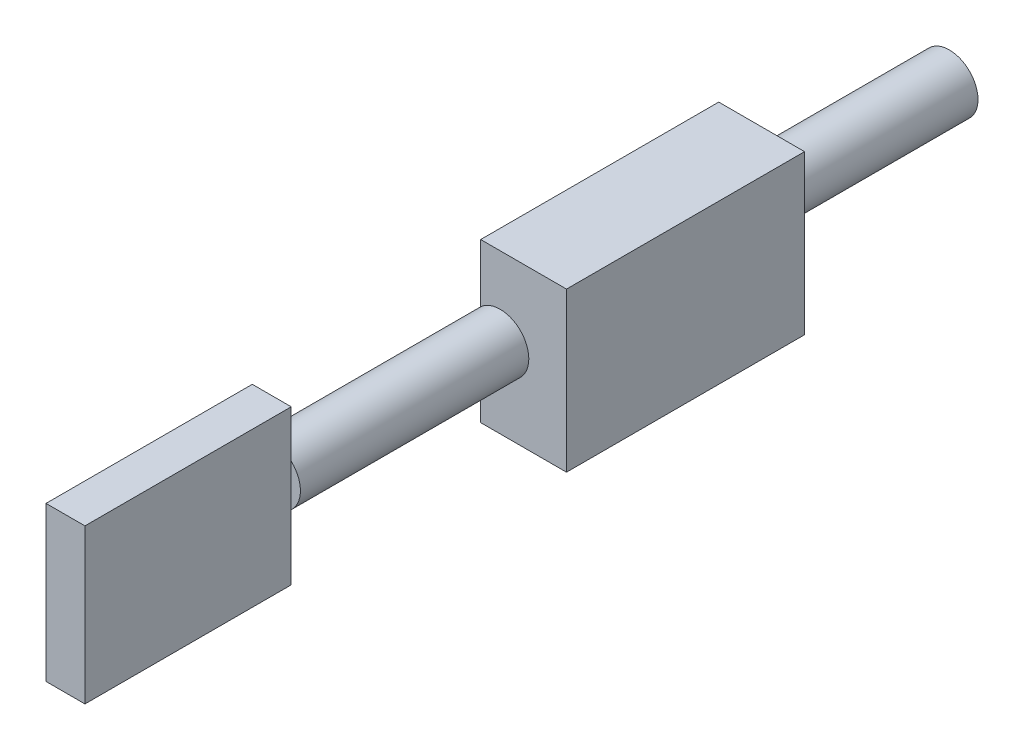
from build123d import *

# Parameters (mm, degrees)
SKETCH1_W             = 33.1
SKETCH1_H             = 24.75
BOSS_EXTRUDE1_DEPTH   = 3.125
SKETCH1_W_2           = 38.2
SKETCH1_H_2           = 25.45
BOSS_EXTRUDE1_2_DEPTH = 3.125
BOSS_EXTRUDE2_START   = -6.25
SKETCH2_W             = 38.2
SKETCH2_H             = 25.45
BOSS_EXTRUDE2_DEPTH   = 7.525
BOSS_EXTRUDE3_REACH   = 144.899
SKETCH3_R             = 4.6


with BuildPart() as part:
    # Sketch1 → Boss-Extrude1 (new, symmetric)
    with BuildSketch(Plane(origin=(0, 0, 0), x_dir=(0, 0, -1), z_dir=(1, 0, 0))):
        with Locations((-125.28, -1.445)):
            Rectangle(SKETCH1_W, SKETCH1_H)
    extrude(amount=BOSS_EXTRUDE1_DEPTH, both=True)

    # Boss-Extrude3: up to this face of the body (flat: up to its plane)
    boss_extrude3_end = Plane(part.part.faces().sort_by_distance((0, -1.445, 108.73))[0])
    # Sketch3 → Boss-Extrude3 (add, up to the picked face)
    with BuildSketch(Plane.XY, mode=Mode.PRIVATE) as boss_extrude3_sk1:
        with Locations(Location((0, 0, 0), (0, 0, 227.207299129))):
            Circle(SKETCH3_R)
    boss_extrude3_tool1 = split(extrude(boss_extrude3_sk1.sketch, amount=BOSS_EXTRUDE3_REACH, mode=Mode.PRIVATE), bisect_by=boss_extrude3_end, keep=Keep.BOTH, mode=Mode.PRIVATE)


with BuildPart() as body_2:
    # Sketch1 → Boss-Extrude1 2 (new, symmetric)
    with BuildSketch(Plane(origin=(0, 0, 0), x_dir=(0, 0, -1), z_dir=(1, 0, 0))):
        with Locations((-52.98, 0)):
            Rectangle(SKETCH1_W_2, SKETCH1_H_2)
    extrude(amount=BOSS_EXTRUDE1_2_DEPTH, both=True)

    # Sketch2 → Boss-Extrude2 (add)
    with BuildSketch(Plane.ZY.offset(3.125).offset(BOSS_EXTRUDE2_START)):
        with Locations((52.98, 0)):
            Rectangle(SKETCH2_W, SKETCH2_H)
    extrude(amount=-BOSS_EXTRUDE2_DEPTH)


with BuildPart() as part_1:
    add(part.part)

    add(body_2.part)  # Boss-Extrude3 merges body 2
    add(boss_extrude3_tool1.solids().sort_by(Axis((0, 0, 0), (0, 0, 1)))[0])


solid = part_1.part
